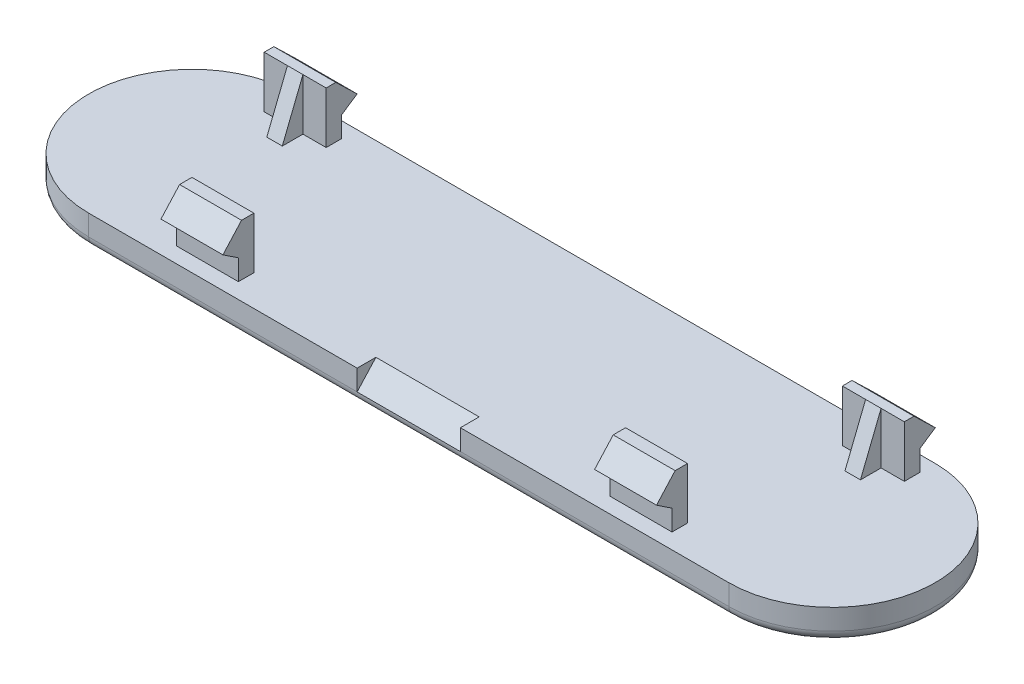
from build123d import *

# Parameters (mm, degrees)
EXTRUDE_1_DEPTH          = 3
FILLET_1_R               = 1
SKETCH_4_W               = 6
SKETCH_4_H               = 3
EXTRUDE_2_DEPTH          = 5
SKETCH_5_W               = 6
SKETCH_5_H               = 3
CUT_EXTRUDE_1_DEPTH      = 1.5
SKETCH_6_W               = 6
SKETCH_6_H               = 3
CUT_EXTRUDE_2_DEPTH      = 1.5
CUT_EXTRUDE_3_DEPTH      = 74.130021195
CUT_EXTRUDE_3_DEPTH_BACK = 74.130021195
CUT_EXTRUDE_5_DEPTH      = 67.2495283
CUT_EXTRUDE_5_DEPTH_BACK = 67.2495283
EXTRUDE_3_DEPTH          = 6
EXTRUDE_4_DEPTH          = 6
EXTRUDE_6_DEPTH          = 6
EXTRUDE_5_DEPTH          = 6
SKETCH_13_W              = 10
SKETCH_13_H              = 4
CUT_EXTRUDE_6_DEPTH      = 2
EXTRUDE_7_REACH          = 49.749
SKETCH_15_W              = 1.5
SKETCH_15_H              = 2
EXTRUDE_8_DEPTH          = 5
SKETCH_16_W              = 1.5
SKETCH_16_H              = 2
EXTRUDE_9_DEPTH          = 5
SKETCH_17_W              = 1.5
SKETCH_17_H              = 2
EXTRUDE_10_DEPTH         = 5
SKETCH_18_W              = 1.5
SKETCH_18_H              = 2
EXTRUDE_11_DEPTH         = 5
CUT_EXTRUDE_7_DEPTH      = 65.043442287
CUT_EXTRUDE_8_DEPTH      = 71.91588327


with BuildPart() as part:
    # Sketch 3 → Extrude 1 (new body)
    with BuildSketch(Plane(origin=(0, 0, 0), x_dir=(1, 0, 0), z_dir=(0, 1, 0))):
        with BuildLine():
            Line((31, -10), (-31, -10))
            ThreePointArc((-31, -10), (-41, 0), (-31, 10))
            Line((-31, 10), (31, 10))
            ThreePointArc((31, 10), (41, 0), (31, -10))
        make_face()
    extrude(amount=EXTRUDE_1_DEPTH)

    # Fillet 1
    fillet_1_edges = [part.edges().sort_by_distance(p)[0] for p in [
        (0, 0, 10),
        (-41, 0, 0),
        (0, 0, -10),
        (41, 0, 0),
    ]]
    fillet(fillet_1_edges, radius=FILLET_1_R)

    # Sketch 4 → Extrude 2 (add)
    with BuildSketch(Plane(origin=(0, 3, 0), x_dir=(1, 0, 0), z_dir=(0, 1, 0))):
        with Locations((-21, -8.5)):
            Rectangle(SKETCH_4_W, SKETCH_4_H)
        with Locations((21, -8.5)):
            Rectangle(SKETCH_4_W, SKETCH_4_H)
        with Locations((-28, 8.5)):
            Rectangle(SKETCH_4_W, SKETCH_4_H)
        with Locations((28, 8.5)):
            Rectangle(SKETCH_4_W, SKETCH_4_H)
    extrude(amount=EXTRUDE_2_DEPTH)

    # Sketch 5 → Cut-Extrude 1 (cut)
    with BuildSketch(Plane(origin=(0, 0, -10), x_dir=(-1, 0, 0), z_dir=(0, 0, -1))):
        with Locations((-28, 4.5)):
            Rectangle(SKETCH_5_W, SKETCH_5_H)
        with Locations((28, 4.5)):
            Rectangle(SKETCH_5_W, SKETCH_5_H)
    extrude(amount=-CUT_EXTRUDE_1_DEPTH, mode=Mode.SUBTRACT)

    # Sketch 6 → Cut-Extrude 2 (cut)
    with BuildSketch(Plane.XY.offset(10)):
        with Locations((-21, 4.5)):
            Rectangle(SKETCH_6_W, SKETCH_6_H)
        with Locations((21, 4.5)):
            Rectangle(SKETCH_6_W, SKETCH_6_H)
    extrude(amount=-CUT_EXTRUDE_2_DEPTH, mode=Mode.SUBTRACT)

    # Sketch 7 → Cut-Extrude 3 (cut, two sides: drawn at the far end of the back side and taken through both)
    with BuildSketch(Plane(origin=(31, 0, 0), x_dir=(0, 0, -1), z_dir=(1, 0, 0)).offset(-CUT_EXTRUDE_3_DEPTH_BACK)):
        Polygon((-29.271680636, 43.98725724), (7.932376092, 8), (10, 6), (47.204056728, -29.98725724), (119.178571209, 44.420856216), (42.702833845, 118.395370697), align=None)
    extrude(amount=CUT_EXTRUDE_3_DEPTH + CUT_EXTRUDE_3_DEPTH_BACK, mode=Mode.SUBTRACT)

    # Sketch 8 → Cut-Extrude 5 (cut, two sides: drawn at the far end of the back side and taken through both)
    with BuildSketch(Plane(origin=(24, 0, 0), x_dir=(0, 0, -1), z_dir=(1, 0, 0)).offset(-CUT_EXTRUDE_5_DEPTH_BACK)):
        Polygon((26.443339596, 46.459905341), (-8.198545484, 8), (-10, 6), (-44.64188508, -32.459905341), (-121.561695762, 36.823864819), (-50.476471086, 115.7436755), align=None)
    extrude(amount=CUT_EXTRUDE_5_DEPTH + CUT_EXTRUDE_5_DEPTH_BACK, mode=Mode.SUBTRACT)

    # Sketch 9 → Extrude 3 (add)
    with BuildSketch(Plane(origin=(24, 0, 0), x_dir=(0, 0, -1), z_dir=(1, 0, 0))):
        Polygon((-10, 6), (-8.5, 5), (-8.5, 6), align=None)
    extrude(amount=-EXTRUDE_3_DEPTH)

    # Sketch 10 → Extrude 4 (add)
    with BuildSketch(Plane(origin=(31, 0, 0), x_dir=(0, 0, -1), z_dir=(1, 0, 0))):
        Polygon((10, 6), (8.5, 5), (8.5, 6), align=None)
    extrude(amount=-EXTRUDE_4_DEPTH)

    # Sketch 12 → Extrude 6 (add)
    with BuildSketch(Plane.ZY.offset(24)):
        Polygon((10, 6), (8.5, 5), (8.5, 6), align=None)
    extrude(amount=-EXTRUDE_6_DEPTH)

    # Sketch 11 → Extrude 5 (add)
    with BuildSketch(Plane.ZY.offset(31)):
        Polygon((-10, 6), (-8.5, 5), (-8.5, 6), align=None)
    extrude(amount=-EXTRUDE_5_DEPTH)

    # Sketch 13 → Cut-Extrude 6 (cut)
    with BuildSketch(Plane(origin=(0, 3, 0), x_dir=(1, 0, 0), z_dir=(0, 1, 0))):
        with Locations((0, -10.182291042)):
            Rectangle(SKETCH_13_W, SKETCH_13_H)
    extrude(amount=-CUT_EXTRUDE_6_DEPTH, mode=Mode.SUBTRACT)

    # Sketch 14 → Extrude 7 (add, up to next)
    with BuildSketch(Plane(origin=(-5, 0, 0), x_dir=(0, 0, -1), z_dir=(1, 0, 0)), mode=Mode.PRIVATE) as extrude_7_sk1:
        Polygon((-8.182291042, 3), (-10, 1), (-8.182291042, 1), align=None)
    extrude_7_tool1 = extrude(extrude_7_sk1.sketch, amount=EXTRUDE_7_REACH, mode=Mode.PRIVATE) - part.part
    add(extrude_7_tool1.solids().sort_by_distance((-5, 1.666667, 8.788194))[0])

    # Sketch 15 → Extrude 8 (add)
    with BuildSketch(Plane(origin=(0, 3, 0), x_dir=(1, 0, 0), z_dir=(0, 1, 0))):
        with Locations((-28, 6)):
            Rectangle(SKETCH_15_W, SKETCH_15_H)
    extrude(amount=EXTRUDE_8_DEPTH)

    # Sketch 16 → Extrude 9 (add)
    with BuildSketch(Plane(origin=(0, 3, 0), x_dir=(1, 0, 0), z_dir=(0, 1, 0))):
        with Locations((28, 6)):
            Rectangle(SKETCH_16_W, SKETCH_16_H)
    extrude(amount=EXTRUDE_9_DEPTH)

    # Sketch 17 → Extrude 10 (add)
    with BuildSketch(Plane(origin=(0, 3, 0), x_dir=(1, 0, 0), z_dir=(0, 1, 0))):
        with Locations((-21, -6)):
            Rectangle(SKETCH_17_W, SKETCH_17_H)
    extrude(amount=EXTRUDE_10_DEPTH)

    # Sketch 18 → Extrude 11 (add)
    with BuildSketch(Plane(origin=(0, 3, 0), x_dir=(1, 0, 0), z_dir=(0, 1, 0))):
        with Locations((21, -6)):
            Rectangle(SKETCH_18_W, SKETCH_18_H)
    extrude(amount=EXTRUDE_11_DEPTH)

    # Sketch 19 → Cut-Extrude 7 (cut, through all)
    with BuildSketch(Plane(origin=(21.75, 0, 0), x_dir=(0, 0, -1), z_dir=(1, 0, 0))):
        Polygon((-7, 8), (-5, 3), (-5, 8), align=None)
    extrude(amount=-CUT_EXTRUDE_7_DEPTH, mode=Mode.SUBTRACT)

    # Sketch 20 → Cut-Extrude 8 (cut, through all)
    with BuildSketch(Plane(origin=(28.75, 0, 0), x_dir=(0, 0, -1), z_dir=(1, 0, 0))):
        Polygon((7, 8), (5, 3), (5, 8), align=None)
    extrude(amount=-CUT_EXTRUDE_8_DEPTH, mode=Mode.SUBTRACT)


solid = part.part
